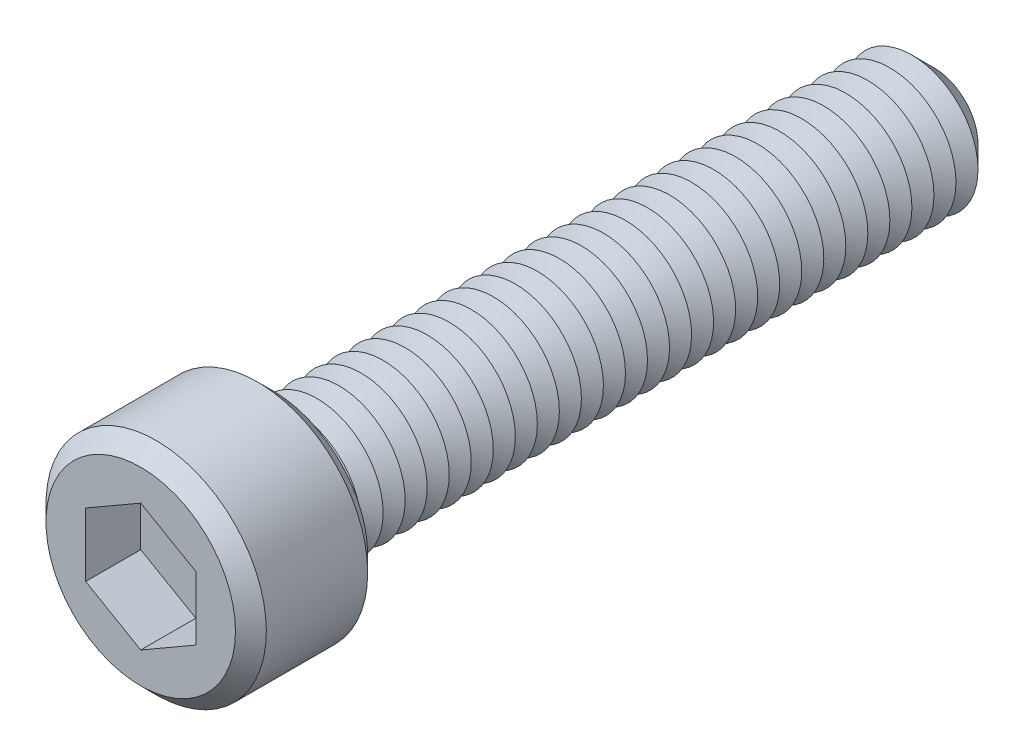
from build123d import *

# Parameters (mm, degrees)
SKETCH1_R           = 5
BOSS_EXTRUDE1_DEPTH = 6
SKETCH2_R           = 3
BOSS_EXTRUDE2_DEPTH = 30
CHAMFER1_SIZE       = 1
LPATTERN1_COUNT     = 29
LPATTERN1_PITCH     = 1
CUT_EXTRUDE1_DEPTH  = 2.5
SKETCH6_R           = 0.8
CUT_EXTRUDE2_DEPTH  = 33.5
CHAMFER2_SIZE       = 0.7


with BuildPart() as part:
    # Sketch1 → Boss-Extrude1 (new body)
    with BuildSketch(Plane.XY):
        Circle(SKETCH1_R)
    extrude(amount=BOSS_EXTRUDE1_DEPTH)

    # Sketch2 → Boss-Extrude2 (add)
    with BuildSketch(Plane(origin=(0, 0, 0), x_dir=(-1, 0, 0), z_dir=(0, 0, -1))):
        Circle(SKETCH2_R)
    extrude(amount=BOSS_EXTRUDE2_DEPTH)

    # Chamfer1
    chamfer1_edges = [part.edges().sort_by_distance(p)[0] for p in [
        (3, 0, -30),
    ]]
    chamfer(chamfer1_edges, length=CHAMFER1_SIZE)

    # Sketch4 → Cut-Revolve1 (revolve, cut)
    with BuildSketch(Plane(origin=(0, 0, 0), x_dir=(0, 0, -1), z_dir=(1, 0, 0)), mode=Mode.PRIVATE) as cut_revolve1_sk:
        Polygon((0, 3), (0.5, 2.133974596), (1, 3), align=None)
    cut_revolve1 = revolve(cut_revolve1_sk.sketch.rotate(Axis((0, 0, 2.512122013), (0, 0, -1)), 90), axis=Axis((0, 0, 2.512122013), (0, 0, -1)), mode=Mode.SUBTRACT)

    # LPattern1: Cut-Revolve1 ×29
    with Locations(*[(0, 0, -i * LPATTERN1_PITCH) for i in range(1, LPATTERN1_COUNT)]):
        add(cut_revolve1, mode=Mode.SUBTRACT)

    # Sketch5 → Cut-Extrude1 (cut)
    with BuildSketch(Plane.XY.offset(6)):
        Polygon((0, 2.886751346), (-2.5, 1.443375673), (-2.5, -1.443375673), (0, -2.886751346), (2.5, -1.443375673), (2.5, 1.443375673), align=None)
    extrude(amount=-CUT_EXTRUDE1_DEPTH, mode=Mode.SUBTRACT)

    # Sketch6 → Cut-Extrude2 (cut)
    with BuildSketch(Plane.XY.offset(3.5)):
        Circle(SKETCH6_R)
    extrude(amount=-CUT_EXTRUDE2_DEPTH, mode=Mode.SUBTRACT)

    # Chamfer2
    chamfer2_edges = [part.edges().sort_by_distance(p)[0] for p in [
        (-5, 0, 0),
        (-5, 0, 6),
    ]]
    chamfer(chamfer2_edges, length=CHAMFER2_SIZE)


solid = part.part
